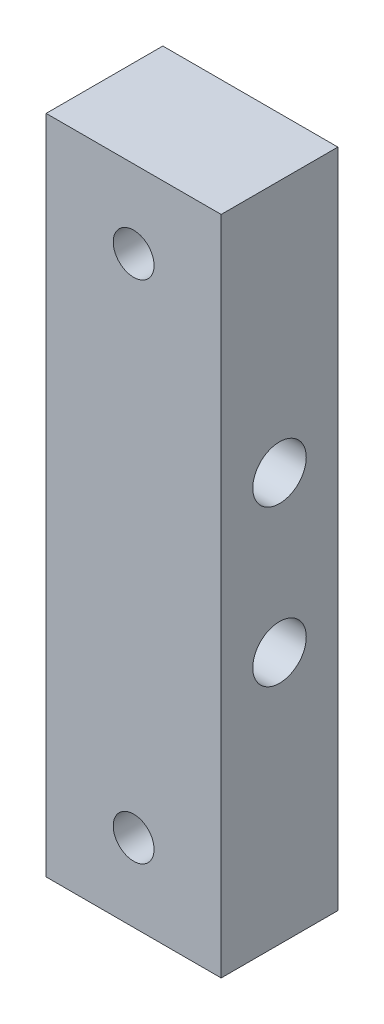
ISO-10303-21;
HEADER;
FILE_DESCRIPTION(('STEP AP214'),'2;1');
FILE_NAME('part.step','',(''),(''),'','','');
FILE_SCHEMA(('AUTOMOTIVE_DESIGN { 1 0 10303 214 1 1 1 1 }'));
ENDSEC;
DATA;
#1=APPLICATION_CONTEXT('core data for automotive mechanical design processes');
#2=APPLICATION_PROTOCOL_DEFINITION('international standard','automotive_design',2000,#1);
#3=PRODUCT_CONTEXT('',#1,'mechanical');
#4=PRODUCT('Part','Part','',(#3));
#5=PRODUCT_RELATED_PRODUCT_CATEGORY('part','',(#4));
#6=PRODUCT_DEFINITION_FORMATION('','',#4);
#7=PRODUCT_DEFINITION_CONTEXT('part definition',#1,'design');
#8=PRODUCT_DEFINITION('design','',#6,#7);
#9=PRODUCT_DEFINITION_SHAPE('','',#8);
#10=(LENGTH_UNIT() NAMED_UNIT(*) SI_UNIT(.MILLI.,.METRE.));
#11=(NAMED_UNIT(*) PLANE_ANGLE_UNIT() SI_UNIT($,.RADIAN.));
#12=(NAMED_UNIT(*) SI_UNIT($,.STERADIAN.) SOLID_ANGLE_UNIT());
#13=UNCERTAINTY_MEASURE_WITH_UNIT(LENGTH_MEASURE(1.E-05),#10,'distance_accuracy_value','');
#14=(GEOMETRIC_REPRESENTATION_CONTEXT(3) GLOBAL_UNCERTAINTY_ASSIGNED_CONTEXT((#13)) GLOBAL_UNIT_ASSIGNED_CONTEXT((#10,
#11,#12)) REPRESENTATION_CONTEXT('',''));
#15=CARTESIAN_POINT('',(0.,0.,0.));
#16=DIRECTION('',(0.,0.,1.));
#17=DIRECTION('',(1.,0.,0.));
#18=AXIS2_PLACEMENT_3D('',#15,#16,#17);
#19=CARTESIAN_POINT('',(0.,68.,-2.22044604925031E-13));
#20=DIRECTION('',(0.,0.,-1.));
#21=DIRECTION('',(-1.,0.,0.));
#22=AXIS2_PLACEMENT_3D('',#19,#20,#21);
#23=PLANE('',#22);
#24=CARTESIAN_POINT('',(9.00000000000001,60.,-2.22044604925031E-13));
#25=DIRECTION('',(0.,0.,1.));
#26=DIRECTION('',(1.,0.,0.));
#27=AXIS2_PLACEMENT_3D('',#24,#25,#26);
#28=CIRCLE('',#27,2.1);
#29=CARTESIAN_POINT('',(11.1,60.,-2.22044604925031E-13));
#30=VERTEX_POINT('',#29);
#31=EDGE_CURVE('E128',#30,#30,#28,.T.);
#32=ORIENTED_EDGE('',*,*,#31,.T.);
#33=EDGE_LOOP('',(#32));
#34=FACE_BOUND('',#33,.T.);
#35=DIRECTION('',(0.,-1.,0.));
#36=VECTOR('',#35,1.);
#37=CARTESIAN_POINT('',(0.,0.,0.));
#38=LINE('',#37,#36);
#39=CARTESIAN_POINT('',(0.,68.,-2.22044604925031E-13));
#40=VERTEX_POINT('',#39);
#41=CARTESIAN_POINT('',(0.,0.,0.));
#42=VERTEX_POINT('',#41);
#43=EDGE_CURVE('E94',#40,#42,#38,.T.);
#44=ORIENTED_EDGE('',*,*,#43,.F.);
#45=DIRECTION('',(-1.,0.,0.));
#46=VECTOR('',#45,1.);
#47=CARTESIAN_POINT('',(0.,68.,-2.22044604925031E-13));
#48=LINE('',#47,#46);
#49=CARTESIAN_POINT('',(18.,68.,-2.22044604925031E-13));
#50=VERTEX_POINT('',#49);
#51=EDGE_CURVE('E70',#50,#40,#48,.T.);
#52=ORIENTED_EDGE('',*,*,#51,.F.);
#53=DIRECTION('',(0.,1.,0.));
#54=VECTOR('',#53,1.);
#55=CARTESIAN_POINT('',(18.,0.,0.));
#56=LINE('',#55,#54);
#57=CARTESIAN_POINT('',(18.,0.,0.));
#58=VERTEX_POINT('',#57);
#59=EDGE_CURVE('E64',#58,#50,#56,.T.);
#60=ORIENTED_EDGE('',*,*,#59,.F.);
#61=DIRECTION('',(1.,0.,0.));
#62=VECTOR('',#61,1.);
#63=CARTESIAN_POINT('',(0.,0.,0.));
#64=LINE('',#63,#62);
#65=EDGE_CURVE('E86',#42,#58,#64,.T.);
#66=ORIENTED_EDGE('',*,*,#65,.F.);
#67=EDGE_LOOP('',(#44,#52,#60,#66));
#68=FACE_BOUND('',#67,.T.);
#69=CARTESIAN_POINT('',(9.00000000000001,8.00000000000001,-2.22044604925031E-13));
#70=DIRECTION('',(0.,0.,1.));
#71=DIRECTION('',(1.,0.,0.));
#72=AXIS2_PLACEMENT_3D('',#69,#70,#71);
#73=CIRCLE('',#72,2.1);
#74=CARTESIAN_POINT('',(11.1,8.00000000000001,-2.22044604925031E-13));
#75=VERTEX_POINT('',#74);
#76=EDGE_CURVE('E122',#75,#75,#73,.T.);
#77=ORIENTED_EDGE('',*,*,#76,.T.);
#78=EDGE_LOOP('',(#77));
#79=FACE_BOUND('',#78,.T.);
#80=ADVANCED_FACE('F30',(#34,#68,#79),#23,.T.);
#81=CARTESIAN_POINT('',(0.,0.,12.));
#82=DIRECTION('',(1.,0.,0.));
#83=DIRECTION('',(0.,0.,-1.));
#84=AXIS2_PLACEMENT_3D('',#81,#82,#83);
#85=PLANE('',#84);
#86=CARTESIAN_POINT('',(0.,42.,6.00000000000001));
#87=DIRECTION('',(1.,0.,0.));
#88=DIRECTION('',(0.,0.,-1.));
#89=AXIS2_PLACEMENT_3D('',#86,#87,#88);
#90=CIRCLE('',#89,2.75);
#91=CARTESIAN_POINT('',(0.,42.,3.25000000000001));
#92=VERTEX_POINT('',#91);
#93=EDGE_CURVE('E116',#92,#92,#90,.T.);
#94=ORIENTED_EDGE('',*,*,#93,.T.);
#95=EDGE_LOOP('',(#94));
#96=FACE_BOUND('',#95,.T.);
#97=CARTESIAN_POINT('',(0.,26.,5.99999999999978));
#98=DIRECTION('',(1.,0.,0.));
#99=DIRECTION('',(0.,0.,-1.));
#100=AXIS2_PLACEMENT_3D('',#97,#98,#99);
#101=CIRCLE('',#100,2.75);
#102=CARTESIAN_POINT('',(0.,26.,3.24999999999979));
#103=VERTEX_POINT('',#102);
#104=EDGE_CURVE('E110',#103,#103,#101,.T.);
#105=ORIENTED_EDGE('',*,*,#104,.T.);
#106=EDGE_LOOP('',(#105));
#107=FACE_BOUND('',#106,.T.);
#108=ORIENTED_EDGE('',*,*,#43,.T.);
#109=DIRECTION('',(0.,0.,-1.));
#110=VECTOR('',#109,1.);
#111=CARTESIAN_POINT('',(0.,0.,12.));
#112=LINE('',#111,#110);
#113=CARTESIAN_POINT('',(0.,0.,12.));
#114=VERTEX_POINT('',#113);
#115=EDGE_CURVE('E11',#114,#42,#112,.T.);
#116=ORIENTED_EDGE('',*,*,#115,.F.);
#117=DIRECTION('',(0.,-1.,0.));
#118=VECTOR('',#117,1.);
#119=CARTESIAN_POINT('',(0.,0.,12.));
#120=LINE('',#119,#118);
#121=CARTESIAN_POINT('',(0.,68.,11.9999999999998));
#122=VERTEX_POINT('',#121);
#123=EDGE_CURVE('E82',#122,#114,#120,.T.);
#124=ORIENTED_EDGE('',*,*,#123,.F.);
#125=DIRECTION('',(0.,0.,-1.));
#126=VECTOR('',#125,1.);
#127=CARTESIAN_POINT('',(0.,68.,11.9999999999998));
#128=LINE('',#127,#126);
#129=EDGE_CURVE('E90',#122,#40,#128,.T.);
#130=ORIENTED_EDGE('',*,*,#129,.T.);
#131=EDGE_LOOP('',(#108,#116,#124,#130));
#132=FACE_BOUND('',#131,.T.);
#133=ADVANCED_FACE('F32',(#96,#107,#132),#85,.F.);
#134=CARTESIAN_POINT('',(0.,0.,12.));
#135=DIRECTION('',(0.,1.,0.));
#136=DIRECTION('',(0.,0.,1.));
#137=AXIS2_PLACEMENT_3D('',#134,#135,#136);
#138=PLANE('',#137);
#139=ORIENTED_EDGE('',*,*,#65,.T.);
#140=DIRECTION('',(0.,0.,-1.));
#141=VECTOR('',#140,1.);
#142=CARTESIAN_POINT('',(18.,0.,11.9999999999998));
#143=LINE('',#142,#141);
#144=CARTESIAN_POINT('',(18.,0.,11.9999999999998));
#145=VERTEX_POINT('',#144);
#146=EDGE_CURVE('E39',#145,#58,#143,.T.);
#147=ORIENTED_EDGE('',*,*,#146,.F.);
#148=DIRECTION('',(1.,0.,0.));
#149=VECTOR('',#148,1.);
#150=CARTESIAN_POINT('',(0.,0.,12.));
#151=LINE('',#150,#149);
#152=EDGE_CURVE('E77',#114,#145,#151,.T.);
#153=ORIENTED_EDGE('',*,*,#152,.F.);
#154=ORIENTED_EDGE('',*,*,#115,.T.);
#155=EDGE_LOOP('',(#139,#147,#153,#154));
#156=FACE_BOUND('',#155,.T.);
#157=ADVANCED_FACE('F85',(#156),#138,.F.);
#158=CARTESIAN_POINT('',(18.,0.,11.9999999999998));
#159=DIRECTION('',(-1.,0.,0.));
#160=DIRECTION('',(0.,0.,1.));
#161=AXIS2_PLACEMENT_3D('',#158,#159,#160);
#162=PLANE('',#161);
#163=CARTESIAN_POINT('',(18.,42.,6.00000000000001));
#164=DIRECTION('',(1.,0.,0.));
#165=DIRECTION('',(0.,0.,-1.));
#166=AXIS2_PLACEMENT_3D('',#163,#164,#165);
#167=CIRCLE('',#166,2.74999999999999);
#168=CARTESIAN_POINT('',(18.,42.,3.25000000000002));
#169=VERTEX_POINT('',#168);
#170=EDGE_CURVE('E113',#169,#169,#167,.T.);
#171=ORIENTED_EDGE('',*,*,#170,.F.);
#172=EDGE_LOOP('',(#171));
#173=FACE_BOUND('',#172,.T.);
#174=CARTESIAN_POINT('',(18.,26.,6.00000000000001));
#175=DIRECTION('',(1.,0.,0.));
#176=DIRECTION('',(0.,0.,-1.));
#177=AXIS2_PLACEMENT_3D('',#174,#175,#176);
#178=CIRCLE('',#177,2.74999999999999);
#179=CARTESIAN_POINT('',(18.,26.,3.25000000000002));
#180=VERTEX_POINT('',#179);
#181=EDGE_CURVE('E97',#180,#180,#178,.T.);
#182=ORIENTED_EDGE('',*,*,#181,.F.);
#183=EDGE_LOOP('',(#182));
#184=FACE_BOUND('',#183,.T.);
#185=ORIENTED_EDGE('',*,*,#59,.T.);
#186=DIRECTION('',(0.,0.,-1.));
#187=VECTOR('',#186,1.);
#188=CARTESIAN_POINT('',(18.,68.,11.9999999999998));
#189=LINE('',#188,#187);
#190=CARTESIAN_POINT('',(18.,68.,11.9999999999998));
#191=VERTEX_POINT('',#190);
#192=EDGE_CURVE('E87',#191,#50,#189,.T.);
#193=ORIENTED_EDGE('',*,*,#192,.F.);
#194=DIRECTION('',(0.,1.,0.));
#195=VECTOR('',#194,1.);
#196=CARTESIAN_POINT('',(18.,0.,11.9999999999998));
#197=LINE('',#196,#195);
#198=EDGE_CURVE('E80',#145,#191,#197,.T.);
#199=ORIENTED_EDGE('',*,*,#198,.F.);
#200=ORIENTED_EDGE('',*,*,#146,.T.);
#201=EDGE_LOOP('',(#185,#193,#199,#200));
#202=FACE_BOUND('',#201,.T.);
#203=ADVANCED_FACE('F88',(#173,#184,#202),#162,.F.);
#204=CARTESIAN_POINT('',(0.,68.,11.9999999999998));
#205=DIRECTION('',(0.,-1.,0.));
#206=DIRECTION('',(0.,0.,-1.));
#207=AXIS2_PLACEMENT_3D('',#204,#205,#206);
#208=PLANE('',#207);
#209=ORIENTED_EDGE('',*,*,#51,.T.);
#210=ORIENTED_EDGE('',*,*,#129,.F.);
#211=DIRECTION('',(-1.,0.,0.));
#212=VECTOR('',#211,1.);
#213=CARTESIAN_POINT('',(0.,68.,11.9999999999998));
#214=LINE('',#213,#212);
#215=EDGE_CURVE('E47',#191,#122,#214,.T.);
#216=ORIENTED_EDGE('',*,*,#215,.F.);
#217=ORIENTED_EDGE('',*,*,#192,.T.);
#218=EDGE_LOOP('',(#209,#210,#216,#217));
#219=FACE_BOUND('',#218,.T.);
#220=ADVANCED_FACE('F102',(#219),#208,.F.);
#221=CARTESIAN_POINT('',(0.,68.,11.9999999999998));
#222=DIRECTION('',(0.,0.,-1.));
#223=DIRECTION('',(-1.,0.,0.));
#224=AXIS2_PLACEMENT_3D('',#221,#222,#223);
#225=PLANE('',#224);
#226=CARTESIAN_POINT('',(8.99999999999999,60.,11.9999999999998));
#227=DIRECTION('',(0.,0.,1.));
#228=DIRECTION('',(1.,0.,0.));
#229=AXIS2_PLACEMENT_3D('',#226,#227,#228);
#230=CIRCLE('',#229,2.09999999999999);
#231=CARTESIAN_POINT('',(11.1,60.,11.9999999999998));
#232=VERTEX_POINT('',#231);
#233=EDGE_CURVE('E125',#232,#232,#230,.T.);
#234=ORIENTED_EDGE('',*,*,#233,.F.);
#235=EDGE_LOOP('',(#234));
#236=FACE_BOUND('',#235,.T.);
#237=CARTESIAN_POINT('',(8.99999999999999,8.00000000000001,11.9999999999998));
#238=DIRECTION('',(0.,0.,1.));
#239=DIRECTION('',(1.,0.,0.));
#240=AXIS2_PLACEMENT_3D('',#237,#238,#239);
#241=CIRCLE('',#240,2.09999999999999);
#242=CARTESIAN_POINT('',(11.1,8.00000000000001,11.9999999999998));
#243=VERTEX_POINT('',#242);
#244=EDGE_CURVE('E119',#243,#243,#241,.T.);
#245=ORIENTED_EDGE('',*,*,#244,.F.);
#246=EDGE_LOOP('',(#245));
#247=FACE_BOUND('',#246,.T.);
#248=ORIENTED_EDGE('',*,*,#123,.T.);
#249=ORIENTED_EDGE('',*,*,#152,.T.);
#250=ORIENTED_EDGE('',*,*,#198,.T.);
#251=ORIENTED_EDGE('',*,*,#215,.T.);
#252=EDGE_LOOP('',(#248,#249,#250,#251));
#253=FACE_BOUND('',#252,.T.);
#254=ADVANCED_FACE('F78',(#236,#247,#253),#225,.F.);
#255=CARTESIAN_POINT('',(18.,26.,6.00000000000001));
#256=DIRECTION('',(1.,0.,0.));
#257=DIRECTION('',(0.,0.,-1.));
#258=AXIS2_PLACEMENT_3D('',#255,#256,#257);
#259=CYLINDRICAL_SURFACE('',#258,2.74999999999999);
#260=ORIENTED_EDGE('',*,*,#104,.F.);
#261=EDGE_LOOP('',(#260));
#262=FACE_BOUND('',#261,.T.);
#263=ORIENTED_EDGE('',*,*,#181,.T.);
#264=EDGE_LOOP('',(#263));
#265=FACE_BOUND('',#264,.T.);
#266=ADVANCED_FACE('F142',(#262,#265),#259,.F.);
#267=CARTESIAN_POINT('',(18.,42.,6.00000000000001));
#268=DIRECTION('',(1.,0.,0.));
#269=DIRECTION('',(0.,0.,-1.));
#270=AXIS2_PLACEMENT_3D('',#267,#268,#269);
#271=CYLINDRICAL_SURFACE('',#270,2.74999999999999);
#272=ORIENTED_EDGE('',*,*,#93,.F.);
#273=EDGE_LOOP('',(#272));
#274=FACE_BOUND('',#273,.T.);
#275=ORIENTED_EDGE('',*,*,#170,.T.);
#276=EDGE_LOOP('',(#275));
#277=FACE_BOUND('',#276,.T.);
#278=ADVANCED_FACE('F147',(#274,#277),#271,.F.);
#279=CARTESIAN_POINT('',(8.99999999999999,8.00000000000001,11.9999999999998));
#280=DIRECTION('',(0.,0.,1.));
#281=DIRECTION('',(1.,0.,0.));
#282=AXIS2_PLACEMENT_3D('',#279,#280,#281);
#283=CYLINDRICAL_SURFACE('',#282,2.09999999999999);
#284=CARTESIAN_POINT('',(11.1,8.00000000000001,-2.22044604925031E-13));
#285=CARTESIAN_POINT('',(11.1,8.00000000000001,0.124999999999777));
#286=CARTESIAN_POINT('',(11.1,8.00000000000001,0.249999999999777));
#287=CARTESIAN_POINT('',(11.1,8.00000000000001,0.499999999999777));
#288=CARTESIAN_POINT('',(11.1,8.00000000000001,0.624999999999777));
#289=CARTESIAN_POINT('',(11.1,8.00000000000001,0.874999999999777));
#290=CARTESIAN_POINT('',(11.1,8.00000000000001,0.999999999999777));
#291=CARTESIAN_POINT('',(11.1,8.00000000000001,1.24999999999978));
#292=CARTESIAN_POINT('',(11.1,8.00000000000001,1.37499999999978));
#293=CARTESIAN_POINT('',(11.1,8.00000000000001,1.62499999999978));
#294=CARTESIAN_POINT('',(11.1,8.00000000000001,1.74999999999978));
#295=CARTESIAN_POINT('',(11.1,8.00000000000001,1.99999999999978));
#296=CARTESIAN_POINT('',(11.1,8.00000000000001,2.12499999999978));
#297=CARTESIAN_POINT('',(11.1,8.00000000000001,2.37499999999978));
#298=CARTESIAN_POINT('',(11.1,8.00000000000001,2.49999999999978));
#299=CARTESIAN_POINT('',(11.1,8.00000000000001,2.74999999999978));
#300=CARTESIAN_POINT('',(11.1,8.00000000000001,2.87499999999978));
#301=CARTESIAN_POINT('',(11.1,8.00000000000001,3.12499999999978));
#302=CARTESIAN_POINT('',(11.1,8.00000000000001,3.24999999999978));
#303=CARTESIAN_POINT('',(11.1,8.00000000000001,3.49999999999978));
#304=CARTESIAN_POINT('',(11.1,8.00000000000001,3.62499999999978));
#305=CARTESIAN_POINT('',(11.1,8.00000000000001,3.87499999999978));
#306=CARTESIAN_POINT('',(11.1,8.00000000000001,3.99999999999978));
#307=CARTESIAN_POINT('',(11.1,8.00000000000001,4.24999999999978));
#308=CARTESIAN_POINT('',(11.1,8.00000000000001,4.37499999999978));
#309=CARTESIAN_POINT('',(11.1,8.00000000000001,4.62499999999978));
#310=CARTESIAN_POINT('',(11.1,8.00000000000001,4.74999999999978));
#311=CARTESIAN_POINT('',(11.1,8.00000000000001,4.99999999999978));
#312=CARTESIAN_POINT('',(11.1,8.00000000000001,5.12499999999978));
#313=CARTESIAN_POINT('',(11.1,8.00000000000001,5.37499999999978));
#314=CARTESIAN_POINT('',(11.1,8.00000000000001,5.49999999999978));
#315=CARTESIAN_POINT('',(11.1,8.00000000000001,5.74999999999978));
#316=CARTESIAN_POINT('',(11.1,8.00000000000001,5.87499999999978));
#317=CARTESIAN_POINT('',(11.1,8.00000000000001,6.12499999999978));
#318=CARTESIAN_POINT('',(11.1,8.00000000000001,6.24999999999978));
#319=CARTESIAN_POINT('',(11.1,8.00000000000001,6.49999999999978));
#320=CARTESIAN_POINT('',(11.1,8.00000000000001,6.62499999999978));
#321=CARTESIAN_POINT('',(11.1,8.00000000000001,6.87499999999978));
#322=CARTESIAN_POINT('',(11.1,8.00000000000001,6.99999999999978));
#323=CARTESIAN_POINT('',(11.1,8.00000000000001,7.24999999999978));
#324=CARTESIAN_POINT('',(11.1,8.00000000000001,7.37499999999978));
#325=CARTESIAN_POINT('',(11.1,8.00000000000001,7.62499999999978));
#326=CARTESIAN_POINT('',(11.1,8.00000000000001,7.74999999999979));
#327=CARTESIAN_POINT('',(11.1,8.00000000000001,7.99999999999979));
#328=CARTESIAN_POINT('',(11.1,8.00000000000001,8.12499999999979));
#329=CARTESIAN_POINT('',(11.1,8.00000000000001,8.37499999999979));
#330=CARTESIAN_POINT('',(11.1,8.00000000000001,8.49999999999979));
#331=CARTESIAN_POINT('',(11.1,8.00000000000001,8.74999999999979));
#332=CARTESIAN_POINT('',(11.1,8.00000000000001,8.87499999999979));
#333=CARTESIAN_POINT('',(11.1,8.00000000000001,9.12499999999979));
#334=CARTESIAN_POINT('',(11.1,8.00000000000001,9.24999999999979));
#335=CARTESIAN_POINT('',(11.1,8.00000000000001,9.49999999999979));
#336=CARTESIAN_POINT('',(11.1,8.00000000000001,9.62499999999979));
#337=CARTESIAN_POINT('',(11.1,8.00000000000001,9.87499999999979));
#338=CARTESIAN_POINT('',(11.1,8.00000000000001,9.99999999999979));
#339=CARTESIAN_POINT('',(11.1,8.00000000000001,10.2499999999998));
#340=CARTESIAN_POINT('',(11.1,8.00000000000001,10.3749999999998));
#341=CARTESIAN_POINT('',(11.1,8.00000000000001,10.6249999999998));
#342=CARTESIAN_POINT('',(11.1,8.00000000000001,10.7499999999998));
#343=CARTESIAN_POINT('',(11.1,8.00000000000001,10.9999999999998));
#344=CARTESIAN_POINT('',(11.1,8.00000000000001,11.1249999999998));
#345=CARTESIAN_POINT('',(11.1,8.00000000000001,11.3749999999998));
#346=CARTESIAN_POINT('',(11.1,8.00000000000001,11.4999999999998));
#347=CARTESIAN_POINT('',(11.1,8.00000000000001,11.7499999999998));
#348=CARTESIAN_POINT('',(11.1,8.00000000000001,11.8749999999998));
#349=CARTESIAN_POINT('',(11.1,8.00000000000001,11.9999999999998));
#350=B_SPLINE_CURVE_WITH_KNOTS('',3,(#284,#285,#286,#287,#288,#289,#290,#291,#292,#293,#294,
#295,#296,#297,#298,#299,#300,#301,#302,#303,#304,#305,#306,#307,#308,#309,#310,#311,#312,#313,
#314,#315,#316,#317,#318,#319,#320,#321,#322,#323,#324,#325,#326,#327,#328,#329,#330,#331,#332,
#333,#334,#335,#336,#337,#338,#339,#340,#341,#342,#343,#344,#345,#346,#347,#348,#349),
.UNSPECIFIED.,.F.,.F.,(4,2,2,2,2,2,2,2,2,2,2,2,2,2,2,2,2,2,2,2,2,2,2,2,2,2,2,2,2,2,2,2,4),(0.,
0.374999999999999,0.749999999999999,1.125,1.5,1.875,2.25,2.625,3.,3.375,3.75,4.125,4.5,4.875,
5.25,5.62500000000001,6.00000000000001,6.375,6.75000000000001,7.12500000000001,7.50000000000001,
7.87500000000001,8.25000000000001,8.62500000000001,9.00000000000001,9.37500000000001,
9.75000000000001,10.125,10.5,10.875,11.25,11.625,12.),.UNSPECIFIED.);
#351=EDGE_CURVE('BSEAM136',#75,#243,#350,.T.);
#352=ORIENTED_EDGE('',*,*,#76,.F.);
#353=ORIENTED_EDGE('',*,*,#244,.T.);
#354=ORIENTED_EDGE('',*,*,#351,.T.);
#355=ORIENTED_EDGE('',*,*,#351,.F.);
#356=EDGE_LOOP('',(#352,#354,#353,#355));
#357=FACE_BOUND('',#356,.T.);
#358=ADVANCED_FACE('F136',(#357),#283,.F.);
#359=CARTESIAN_POINT('',(8.99999999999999,60.,11.9999999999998));
#360=DIRECTION('',(0.,0.,1.));
#361=DIRECTION('',(1.,0.,0.));
#362=AXIS2_PLACEMENT_3D('',#359,#360,#361);
#363=CYLINDRICAL_SURFACE('',#362,2.09999999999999);
#364=CARTESIAN_POINT('',(11.1,60.,-2.22044604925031E-13));
#365=CARTESIAN_POINT('',(11.1,60.,0.124999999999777));
#366=CARTESIAN_POINT('',(11.1,60.,0.249999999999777));
#367=CARTESIAN_POINT('',(11.1,60.,0.499999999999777));
#368=CARTESIAN_POINT('',(11.1,60.,0.624999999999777));
#369=CARTESIAN_POINT('',(11.1,60.,0.874999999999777));
#370=CARTESIAN_POINT('',(11.1,60.,0.999999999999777));
#371=CARTESIAN_POINT('',(11.1,60.,1.24999999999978));
#372=CARTESIAN_POINT('',(11.1,60.,1.37499999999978));
#373=CARTESIAN_POINT('',(11.1,60.,1.62499999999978));
#374=CARTESIAN_POINT('',(11.1,60.,1.74999999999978));
#375=CARTESIAN_POINT('',(11.1,60.,1.99999999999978));
#376=CARTESIAN_POINT('',(11.1,60.,2.12499999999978));
#377=CARTESIAN_POINT('',(11.1,60.,2.37499999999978));
#378=CARTESIAN_POINT('',(11.1,60.,2.49999999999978));
#379=CARTESIAN_POINT('',(11.1,60.,2.74999999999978));
#380=CARTESIAN_POINT('',(11.1,60.,2.87499999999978));
#381=CARTESIAN_POINT('',(11.1,60.,3.12499999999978));
#382=CARTESIAN_POINT('',(11.1,60.,3.24999999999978));
#383=CARTESIAN_POINT('',(11.1,60.,3.49999999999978));
#384=CARTESIAN_POINT('',(11.1,60.,3.62499999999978));
#385=CARTESIAN_POINT('',(11.1,60.,3.87499999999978));
#386=CARTESIAN_POINT('',(11.1,60.,3.99999999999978));
#387=CARTESIAN_POINT('',(11.1,60.,4.24999999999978));
#388=CARTESIAN_POINT('',(11.1,60.,4.37499999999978));
#389=CARTESIAN_POINT('',(11.1,60.,4.62499999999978));
#390=CARTESIAN_POINT('',(11.1,60.,4.74999999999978));
#391=CARTESIAN_POINT('',(11.1,60.,4.99999999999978));
#392=CARTESIAN_POINT('',(11.1,60.,5.12499999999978));
#393=CARTESIAN_POINT('',(11.1,60.,5.37499999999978));
#394=CARTESIAN_POINT('',(11.1,60.,5.49999999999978));
#395=CARTESIAN_POINT('',(11.1,60.,5.74999999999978));
#396=CARTESIAN_POINT('',(11.1,60.,5.87499999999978));
#397=CARTESIAN_POINT('',(11.1,60.,6.12499999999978));
#398=CARTESIAN_POINT('',(11.1,60.,6.24999999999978));
#399=CARTESIAN_POINT('',(11.1,60.,6.49999999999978));
#400=CARTESIAN_POINT('',(11.1,60.,6.62499999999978));
#401=CARTESIAN_POINT('',(11.1,60.,6.87499999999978));
#402=CARTESIAN_POINT('',(11.1,60.,6.99999999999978));
#403=CARTESIAN_POINT('',(11.1,60.,7.24999999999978));
#404=CARTESIAN_POINT('',(11.1,60.,7.37499999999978));
#405=CARTESIAN_POINT('',(11.1,60.,7.62499999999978));
#406=CARTESIAN_POINT('',(11.1,60.,7.74999999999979));
#407=CARTESIAN_POINT('',(11.1,60.,7.99999999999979));
#408=CARTESIAN_POINT('',(11.1,60.,8.12499999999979));
#409=CARTESIAN_POINT('',(11.1,60.,8.37499999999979));
#410=CARTESIAN_POINT('',(11.1,60.,8.49999999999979));
#411=CARTESIAN_POINT('',(11.1,60.,8.74999999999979));
#412=CARTESIAN_POINT('',(11.1,60.,8.87499999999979));
#413=CARTESIAN_POINT('',(11.1,60.,9.12499999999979));
#414=CARTESIAN_POINT('',(11.1,60.,9.24999999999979));
#415=CARTESIAN_POINT('',(11.1,60.,9.49999999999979));
#416=CARTESIAN_POINT('',(11.1,60.,9.62499999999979));
#417=CARTESIAN_POINT('',(11.1,60.,9.87499999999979));
#418=CARTESIAN_POINT('',(11.1,60.,9.99999999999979));
#419=CARTESIAN_POINT('',(11.1,60.,10.2499999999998));
#420=CARTESIAN_POINT('',(11.1,60.,10.3749999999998));
#421=CARTESIAN_POINT('',(11.1,60.,10.6249999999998));
#422=CARTESIAN_POINT('',(11.1,60.,10.7499999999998));
#423=CARTESIAN_POINT('',(11.1,60.,10.9999999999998));
#424=CARTESIAN_POINT('',(11.1,60.,11.1249999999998));
#425=CARTESIAN_POINT('',(11.1,60.,11.3749999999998));
#426=CARTESIAN_POINT('',(11.1,60.,11.4999999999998));
#427=CARTESIAN_POINT('',(11.1,60.,11.7499999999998));
#428=CARTESIAN_POINT('',(11.1,60.,11.8749999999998));
#429=CARTESIAN_POINT('',(11.1,60.,11.9999999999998));
#430=B_SPLINE_CURVE_WITH_KNOTS('',3,(#364,#365,#366,#367,#368,#369,#370,#371,#372,#373,#374,
#375,#376,#377,#378,#379,#380,#381,#382,#383,#384,#385,#386,#387,#388,#389,#390,#391,#392,#393,
#394,#395,#396,#397,#398,#399,#400,#401,#402,#403,#404,#405,#406,#407,#408,#409,#410,#411,#412,
#413,#414,#415,#416,#417,#418,#419,#420,#421,#422,#423,#424,#425,#426,#427,#428,#429),
.UNSPECIFIED.,.F.,.F.,(4,2,2,2,2,2,2,2,2,2,2,2,2,2,2,2,2,2,2,2,2,2,2,2,2,2,2,2,2,2,2,2,4),(0.,
0.374999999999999,0.749999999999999,1.125,1.5,1.875,2.25,2.625,3.,3.375,3.75,4.125,4.5,4.875,
5.25,5.62500000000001,6.00000000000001,6.375,6.75000000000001,7.12500000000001,7.50000000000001,
7.87500000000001,8.25000000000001,8.62500000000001,9.00000000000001,9.37500000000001,
9.75000000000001,10.125,10.5,10.875,11.25,11.625,12.),.UNSPECIFIED.);
#431=EDGE_CURVE('BSEAM133',#30,#232,#430,.T.);
#432=ORIENTED_EDGE('',*,*,#31,.F.);
#433=ORIENTED_EDGE('',*,*,#233,.T.);
#434=ORIENTED_EDGE('',*,*,#431,.T.);
#435=ORIENTED_EDGE('',*,*,#431,.F.);
#436=EDGE_LOOP('',(#432,#434,#433,#435));
#437=FACE_BOUND('',#436,.T.);
#438=ADVANCED_FACE('F133',(#437),#363,.F.);
#439=CLOSED_SHELL('',(#80,#133,#157,#203,#220,#254,#266,#278,#358,#438));
#440=MANIFOLD_SOLID_BREP('B2',#439);
#441=ADVANCED_BREP_SHAPE_REPRESENTATION('',(#18,#440),#14);
#442=SHAPE_DEFINITION_REPRESENTATION(#9,#441);
ENDSEC;
END-ISO-10303-21;
